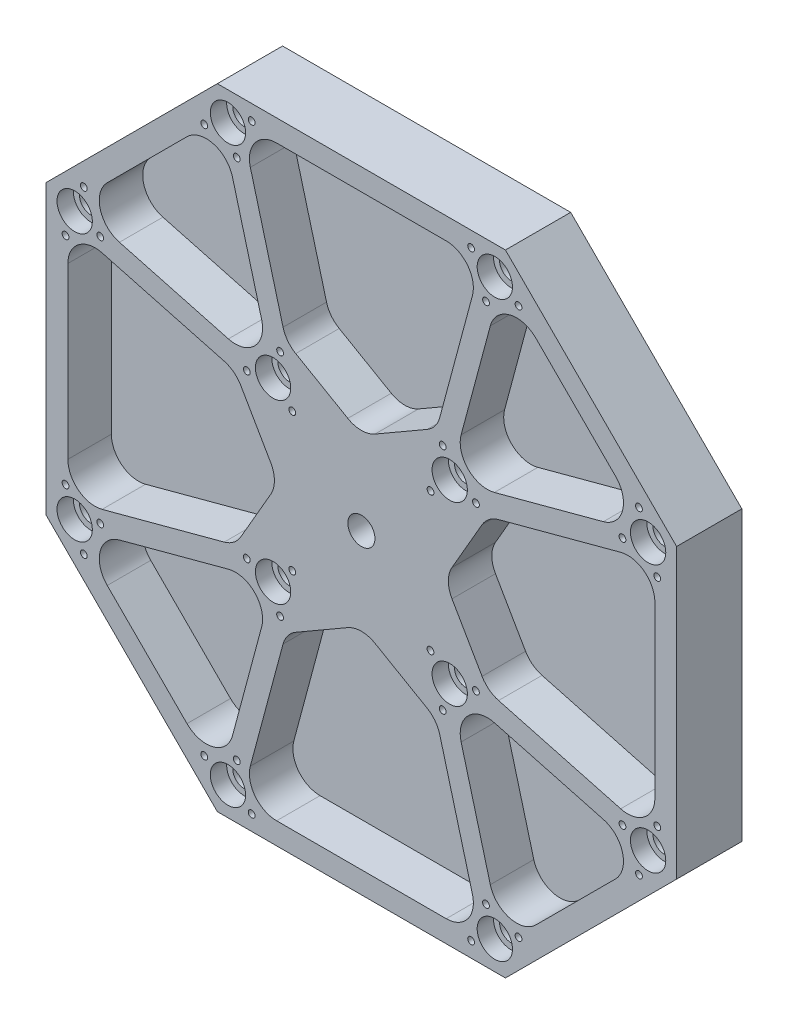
from build123d import *

# Parameters (mm, degrees)
BOSS_EXTRUDE1_DEPTH                              = 19.05
CUT_EXTRUDE1_DEPTH                               = 12.7
CIRPATTERN1_COUNT                                = 4
CUT_EXTRUDE2_DEPTH                               = 12.7
CIRPATTERN2_COUNT                                = 4
F_5_16_0_3125_DIAMETER_HOLE1_D                   = 7.9375
CBORE_FOR_1_4_SOCKET_SHOULDER_SCREW1_D           = 6.7564
CBORE_FOR_1_4_SOCKET_SHOULDER_SCREW1_CBORE_D     = 10.31748
CBORE_FOR_1_4_SOCKET_SHOULDER_SCREW1_CBORE_DEPTH = 4.7752
CIRPATTERN3_COUNT                                = 3
CIRPATTERN4_COUNT                                = 4
CBORE_FOR_1_4_SOCKET_SHOULDER_SCREW2_D           = 6.7564
CBORE_FOR_1_4_SOCKET_SHOULDER_SCREW2_CBORE_D     = 10.31748
CBORE_FOR_1_4_SOCKET_SHOULDER_SCREW2_CBORE_DEPTH = 4.7752
F_5_64_0_07813_DIAMETER_HOLE2_AT_2_COUNT         = 2
F_5_64_0_07813_DIAMETER_HOLE2_AT_2_PITCH         = 11.225320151
F_5_64_0_07813_DIAMETER_HOLE2_AT_3_COUNT         = 2
F_5_64_0_07813_DIAMETER_HOLE2_AT_3_PITCH         = 11.225320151
MIRROR2_COPY_3_D                                 = 6.7564
MIRROR2_COPY_3_CBORE_D                           = 10.31748
MIRROR2_COPY_3_CBORE_DEPTH                       = 4.7752
CBORE_FOR_1_4_SOCKET_SHOULDER_SCREW3_D           = 6.7564
CBORE_FOR_1_4_SOCKET_SHOULDER_SCREW3_CBORE_D     = 10.31748
CBORE_FOR_1_4_SOCKET_SHOULDER_SCREW3_CBORE_DEPTH = 4.7752
F_5_64_0_07813_DIAMETER_HOLE3_AT_2_COUNT         = 2
F_5_64_0_07813_DIAMETER_HOLE3_AT_2_PITCH         = 10.16390864
F_5_64_0_07813_DIAMETER_HOLE3_AT_3_COUNT         = 2
F_5_64_0_07813_DIAMETER_HOLE3_AT_3_PITCH         = 12.194695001
MIRROR4_COPY_3_D                                 = 6.7564
MIRROR4_COPY_3_CBORE_D                           = 10.31748
MIRROR4_COPY_3_CBORE_DEPTH                       = 4.7752


with BuildPart() as part:
    # Sketch1 → Boss-Extrude1 (new body)
    with BuildSketch(Plane.XY):
        Polygon((-42.075, 92.075), (42.075, 92.075), (92.075, 42.075), (92.075, -42.075), (42.075, -92.075), (-42.075, -92.075), (-92.075, -42.075), (-92.075, 42.075), align=None)
    extrude(amount=-BOSS_EXTRUDE1_DEPTH)

    # Sketch2 → Cut-Extrude1 (cut)
    with BuildSketch(Plane.XY):
        with BuildLine():
            Line((-24.770749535, 85.725), (24.770749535, 85.725))
            ThreePointArc((24.770749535, 85.725), (31.067991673, 82.619543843), (32.437785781, 75.733123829))
            Line((32.437785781, 75.733123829), (22.88106218, 40.066945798))
            ThreePointArc((22.88106218, 40.066945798), (21.511268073, 37.289278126), (19.182775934, 35.247245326))
            Line((19.182775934, 35.247245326), (3.96875, 26.463423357))
            ThreePointArc((3.96875, 26.463423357), (0, 25.4), (-3.96875, 26.463423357))
            Line((-3.96875, 26.463423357), (-19.182775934, 35.247245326))
            ThreePointArc((-19.182775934, 35.247245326), (-21.511268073, 37.289278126), (-22.88106218, 40.066945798))
            Line((-22.88106218, 40.066945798), (-32.437785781, 75.733123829))
            ThreePointArc((-32.437785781, 75.733123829), (-31.067991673, 82.619543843), (-24.770749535, 85.725))
        make_face()
    cut_extrude1 = extrude(amount=-CUT_EXTRUDE1_DEPTH, mode=Mode.SUBTRACT)

    # CirPattern1: Cut-Extrude1 ×4 about axis
    cirpattern1_axis = Axis((0, 0, 0), (0, 0, 1))
    for i in range(1, CIRPATTERN1_COUNT):
        add(cut_extrude1.rotate(cirpattern1_axis, i * 360 / CIRPATTERN1_COUNT), mode=Mode.SUBTRACT)

    # Sketch4 → Cut-Extrude2 (cut)
    with BuildSketch(Plane.XY):
        with BuildLine():
            Line((74.233516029, 50.93622785), (50.93622785, 74.233516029))
            ThreePointArc((50.93622785, 74.233516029), (43.269191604, 76.287892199), (37.656531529, 70.675232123))
            Line((37.656531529, 70.675232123), (29.129132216, 38.850544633))
            ThreePointArc((29.129132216, 38.850544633), (31.183508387, 31.183508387), (38.850544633, 29.129132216))
            Line((38.850544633, 29.129132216), (70.675232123, 37.656531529))
            ThreePointArc((70.675232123, 37.656531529), (76.287892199, 43.269191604), (74.233516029, 50.93622785))
        make_face()
    cut_extrude2 = extrude(amount=-CUT_EXTRUDE2_DEPTH, mode=Mode.SUBTRACT)

    # CirPattern2: Cut-Extrude2 ×4 about axis
    cirpattern2_axis = Axis((0, 0, 0), (0, 0, 1))
    for i in range(1, CIRPATTERN2_COUNT):
        add(cut_extrude2.rotate(cirpattern2_axis, i * 360 / CIRPATTERN2_COUNT), mode=Mode.SUBTRACT)

    # 5_16 _0.3125_ Diameter Hole1 (through all)
    with Locations(Plane.XY):
        with Locations((0, 0)):
            Hole(F_5_16_0_3125_DIAMETER_HOLE1_D / 2)

    # CBORE for 1_4 Socket Shoulder Screw1 (through all)
    with Locations(Plane.XY):
        with Locations((-25.795354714, -25.795354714)):
            cbore_for_1_4_socket_shoulder_screw1 = CounterBoreHole(CBORE_FOR_1_4_SOCKET_SHOULDER_SCREW1_D / 2, CBORE_FOR_1_4_SOCKET_SHOULDER_SCREW1_CBORE_D / 2, CBORE_FOR_1_4_SOCKET_SHOULDER_SCREW1_CBORE_DEPTH)

    # Sketch11 → 5_64 _0.07813_ Diameter Hole1 (revolve, cut)
    with BuildSketch(Plane(origin=(-20.182694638, -20.182694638, 0), x_dir=(0, -1, 0), z_dir=(1, 0, 0))):
        Polygon((0, 0), (0, 6.94620455), (0.992251, 6.35), (0.992251, 0), align=None)
    f_5_64_0_07813_diameter_hole1 = revolve(axis=Axis((-20.182694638, -20.182694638, 6.35), (0, 0, -1)), mode=Mode.SUBTRACT)

    # CirPattern3: 5_64 _0.07813_ Diameter Hole1 ×3 about axis
    cirpattern3_axis = Axis((-25.795354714, -25.795354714, 0), (0, 0, 1))
    for i in range(1, CIRPATTERN3_COUNT):
        add(f_5_64_0_07813_diameter_hole1.rotate(cirpattern3_axis, i * 360 / CIRPATTERN3_COUNT), mode=Mode.SUBTRACT)

    # CirPattern4: CBORE for 1_4 Socket Shoulder Screw1, 5_64 _0.07813_ Diameter Hole1 ×4 about axis
    cirpattern4_axis = Axis((0, 0, 0), (0, 0, 1))
    add([cbore_for_1_4_socket_shoulder_screw1.rotate(cirpattern4_axis, i * 360 / CIRPATTERN4_COUNT) for i in range(1, CIRPATTERN4_COUNT)], mode=Mode.SUBTRACT)
    add([f_5_64_0_07813_diameter_hole1.rotate(cirpattern4_axis, i * 360 / CIRPATTERN4_COUNT) for i in range(1, CIRPATTERN4_COUNT)], mode=Mode.SUBTRACT)

    # CirPattern4 copy 1 sketch → CirPattern4 copy 1 (revolve, cut)
    with BuildSketch(Plane(origin=(23.740978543, -33.46239096, 0), x_dir=(-0.4999999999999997, 0.8660254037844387, 0), z_dir=(-0.8660254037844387, -0.4999999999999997, 0))):
        Polygon((0, 0), (0, 6.94620455), (0.992251, 6.35), (0.992251, 0), align=None)
    revolve(axis=Axis((23.740978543, -33.46239096, 6.35), (0, 0, -1)), mode=Mode.SUBTRACT)

    # CirPattern4 copy 2 sketch → CirPattern4 copy 2 (revolve, cut)
    with BuildSketch(Plane(origin=(33.46239096, 23.740978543, 0), x_dir=(-0.8660254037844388, -0.49999999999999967, 0), z_dir=(0.49999999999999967, -0.8660254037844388, 0))):
        Polygon((0, 0), (0, 6.94620455), (0.992251, 6.35), (0.992251, 0), align=None)
    revolve(axis=Axis((33.46239096, 23.740978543, 6.35), (0, 0, -1)), mode=Mode.SUBTRACT)

    # CirPattern4 copy 3 sketch → CirPattern4 copy 3 (revolve, cut)
    with BuildSketch(Plane(origin=(-23.740978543, 33.46239096, 0), x_dir=(0.4999999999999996, -0.8660254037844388, 0), z_dir=(0.8660254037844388, 0.4999999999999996, 0))):
        Polygon((0, 0), (0, 6.94620455), (0.992251, 6.35), (0.992251, 0), align=None)
    revolve(axis=Axis((-23.740978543, 33.46239096, 6.35), (0, 0, -1)), mode=Mode.SUBTRACT)

    # CirPattern4 copy 4 sketch → CirPattern4 copy 4 (revolve, cut)
    with BuildSketch(Plane(origin=(33.46239096, -23.740978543, 0), x_dir=(-0.5000000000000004, -0.8660254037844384, 0), z_dir=(0.8660254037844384, -0.5000000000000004, 0))):
        Polygon((0, 0), (0, 6.94620455), (0.992251, 6.35), (0.992251, 0), align=None)
    revolve(axis=Axis((33.46239096, -23.740978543, 6.35), (0, 0, -1)), mode=Mode.SUBTRACT)

    # CirPattern4 copy 5 sketch → CirPattern4 copy 5 (revolve, cut)
    with BuildSketch(Plane(origin=(23.740978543, 33.46239096, 0), x_dir=(0.8660254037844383, -0.5000000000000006, 0), z_dir=(0.5000000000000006, 0.8660254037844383, 0))):
        Polygon((0, 0), (0, 6.94620455), (0.992251, 6.35), (0.992251, 0), align=None)
    revolve(axis=Axis((23.740978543, 33.46239096, 6.35), (0, 0, -1)), mode=Mode.SUBTRACT)

    # CirPattern4 copy 6 sketch → CirPattern4 copy 6 (revolve, cut)
    with BuildSketch(Plane(origin=(-33.46239096, 23.740978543, 0), x_dir=(0.5000000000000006, 0.8660254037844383, 0), z_dir=(-0.8660254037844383, 0.5000000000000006, 0))):
        Polygon((0, 0), (0, 6.94620455), (0.992251, 6.35), (0.992251, 0), align=None)
    revolve(axis=Axis((-33.46239096, 23.740978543, 6.35), (0, 0, -1)), mode=Mode.SUBTRACT)

    # CBORE for 1_4 Socket Shoulder Screw2 (through all)
    with Locations(Plane.XY):
        with Locations((83.743984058, 38.972376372)):
            cbore_for_1_4_socket_shoulder_screw2 = CounterBoreHole(CBORE_FOR_1_4_SOCKET_SHOULDER_SCREW2_D / 2, CBORE_FOR_1_4_SOCKET_SHOULDER_SCREW2_CBORE_D / 2, CBORE_FOR_1_4_SOCKET_SHOULDER_SCREW2_CBORE_DEPTH)

    # Sketch15 → 5_64 _0.07813_ Diameter Hole2 (revolve, cut)
    with BuildSketch(Plane(origin=(76.270596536, 36.297982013, 0), x_dir=(0, -1, 0), z_dir=(1, 0, 0))):
        Polygon((0, 0), (0, 6.94620455), (0.992251, 6.35), (0.992251, 0), align=None)
    f_5_64_0_07813_diameter_hole2 = revolve(axis=Axis((76.270596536, 36.297982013, 6.35), (0, 0, -1)), mode=Mode.SUBTRACT)

    # 5_64 _0.07813_ Diameter Hole2 at 2: 5_64 _0.07813_ Diameter Hole2 ×2
    with Locations(*[Vector(0.9040082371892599, -0.427515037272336, 0) * (i * F_5_64_0_07813_DIAMETER_HOLE2_AT_2_PITCH) for i in range(1, F_5_64_0_07813_DIAMETER_HOLE2_AT_2_COUNT)]):
        add(f_5_64_0_07813_diameter_hole2, mode=Mode.SUBTRACT)

    # 5_64 _0.07813_ Diameter Hole2 at 3: 5_64 _0.07813_ Diameter Hole2 ×2
    with Locations(*[Vector(0.42751503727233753, 0.9040082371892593, 0) * (i * F_5_64_0_07813_DIAMETER_HOLE2_AT_3_PITCH) for i in range(1, F_5_64_0_07813_DIAMETER_HOLE2_AT_3_COUNT)]):
        add(f_5_64_0_07813_diameter_hole2, mode=Mode.SUBTRACT)

    # Mirror1: CBORE for 1_4 Socket Shoulder Screw2, 5_64 _0.07813_ Diameter Hole2 across plane
    add(cbore_for_1_4_socket_shoulder_screw2.mirror(Plane.ZX), mode=Mode.SUBTRACT)
    add(f_5_64_0_07813_diameter_hole2.mirror(Plane.ZX), mode=Mode.SUBTRACT)

    # Mirror1 copy 1 sketch → Mirror1 copy 1 (revolve, cut)
    with BuildSketch(Plane(origin=(86.418378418, -31.49898885, 0), x_dir=(0, 1, 0), z_dir=(1, 0, 0))):
        Polygon((0, 0), (0, -6.94620455), (0.992251, -6.35), (0.992251, 0), align=None)
    revolve(axis=Axis((86.418378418, -31.49898885, 6.35), (0, 0, 1)), mode=Mode.SUBTRACT)

    # Mirror1 copy 2 sketch → Mirror1 copy 2 (revolve, cut)
    with BuildSketch(Plane(origin=(81.069589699, -46.445763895, 0), x_dir=(0, 1, 0), z_dir=(1, 0, 0))):
        Polygon((0, 0), (0, -6.94620455), (0.992251, -6.35), (0.992251, 0), align=None)
    revolve(axis=Axis((81.069589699, -46.445763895, 6.35), (0, 0, 1)), mode=Mode.SUBTRACT)

    # Mirror2: CBORE for 1_4 Socket Shoulder Screw2, 5_64 _0.07813_ Diameter Hole2 across plane
    add(cbore_for_1_4_socket_shoulder_screw2.mirror(Plane(origin=(0, 0, 0), x_dir=(0, 0, 1), z_dir=(1, 0, 0))), mode=Mode.SUBTRACT)
    add(f_5_64_0_07813_diameter_hole2.mirror(Plane(origin=(0, 0, 0), x_dir=(0, 0, 1), z_dir=(1, 0, 0))), mode=Mode.SUBTRACT)

    # Mirror2 copy 1 sketch → Mirror2 copy 1 (revolve, cut)
    with BuildSketch(Plane(origin=(-86.418378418, 31.49898885, 0), x_dir=(0, -1, 0), z_dir=(-1, 0, 0))):
        Polygon((0, 0), (0, -6.94620455), (0.992251, -6.35), (0.992251, 0), align=None)
    revolve(axis=Axis((-86.418378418, 31.49898885, 6.35), (0, 0, 1)), mode=Mode.SUBTRACT)

    # Mirror2 copy 2 sketch → Mirror2 copy 2 (revolve, cut)
    with BuildSketch(Plane(origin=(-81.069589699, 46.445763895, 0), x_dir=(0, -1, 0), z_dir=(-1, 0, 0))):
        Polygon((0, 0), (0, -6.94620455), (0.992251, -6.35), (0.992251, 0), align=None)
    revolve(axis=Axis((-81.069589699, 46.445763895, 6.35), (0, 0, 1)), mode=Mode.SUBTRACT)

    # Mirror2 copy 3 (through all)
    with Locations(Plane(origin=(0, 0, 0), x_dir=(-1, 0, 0), z_dir=(0, 0, 1))):
        with Locations((83.743984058, 38.972376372)):
            CounterBoreHole(MIRROR2_COPY_3_D / 2, MIRROR2_COPY_3_CBORE_D / 2, MIRROR2_COPY_3_CBORE_DEPTH)

    # Mirror2 copy 4 sketch → Mirror2 copy 4 (revolve, cut)
    with BuildSketch(Plane(origin=(-76.270596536, -36.297982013, 0), x_dir=(0, 1, 0), z_dir=(-1, 0, 0))):
        Polygon((0, 0), (0, 6.94620455), (0.992251, 6.35), (0.992251, 0), align=None)
    revolve(axis=Axis((-76.270596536, -36.297982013, 6.35), (0, 0, -1)), mode=Mode.SUBTRACT)

    # Mirror2 copy 5 sketch → Mirror2 copy 5 (revolve, cut)
    with BuildSketch(Plane(origin=(-86.418378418, -31.49898885, 0), x_dir=(0, 1, 0), z_dir=(-1, 0, 0))):
        Polygon((0, 0), (0, 6.94620455), (0.992251, 6.35), (0.992251, 0), align=None)
    revolve(axis=Axis((-86.418378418, -31.49898885, 6.35), (0, 0, -1)), mode=Mode.SUBTRACT)

    # Mirror2 copy 6 sketch → Mirror2 copy 6 (revolve, cut)
    with BuildSketch(Plane(origin=(-81.069589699, -46.445763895, 0), x_dir=(0, 1, 0), z_dir=(-1, 0, 0))):
        Polygon((0, 0), (0, 6.94620455), (0.992251, 6.35), (0.992251, 0), align=None)
    revolve(axis=Axis((-81.069589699, -46.445763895, 6.35), (0, 0, -1)), mode=Mode.SUBTRACT)

    # CBORE for 1_4 Socket Shoulder Screw3 (through all)
    with Locations(Plane.XY):
        with Locations((38.972376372, 83.743984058)):
            cbore_for_1_4_socket_shoulder_screw3 = CounterBoreHole(CBORE_FOR_1_4_SOCKET_SHOULDER_SCREW3_D / 2, CBORE_FOR_1_4_SOCKET_SHOULDER_SCREW3_CBORE_D / 2, CBORE_FOR_1_4_SOCKET_SHOULDER_SCREW3_CBORE_DEPTH)

    # Sketch20 → 5_64 _0.07813_ Diameter Hole3 (revolve, cut)
    with BuildSketch(Plane(origin=(36.396939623, 76.235919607, 0), x_dir=(0, -1, 0), z_dir=(1, 0, 0))):
        Polygon((0, 0), (0, 6.94620455), (0.992251, 6.35), (0.992251, 0), align=None)
    f_5_64_0_07813_diameter_hole3 = revolve(axis=Axis((36.396939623, 76.235919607, 6.35), (0, 0, -1)), mode=Mode.SUBTRACT)

    # 5_64 _0.07813_ Diameter Hole3 at 2: 5_64 _0.07813_ Diameter Hole3 ×2
    with Locations(*[Vector(0.9343473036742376, 0.35636374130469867, 0) * (i * F_5_64_0_07813_DIAMETER_HOLE3_AT_2_PITCH) for i in range(1, F_5_64_0_07813_DIAMETER_HOLE3_AT_2_COUNT)]):
        add(f_5_64_0_07813_diameter_hole3, mode=Mode.SUBTRACT)

    # 5_64 _0.07813_ Diameter Hole3 at 3: 5_64 _0.07813_ Diameter Hole3 ×2
    with Locations(*[Vector(-0.356363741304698, 0.9343473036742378, 0) * (i * F_5_64_0_07813_DIAMETER_HOLE3_AT_3_PITCH) for i in range(1, F_5_64_0_07813_DIAMETER_HOLE3_AT_3_COUNT)]):
        add(f_5_64_0_07813_diameter_hole3, mode=Mode.SUBTRACT)

    # Mirror3: CBORE for 1_4 Socket Shoulder Screw3, 5_64 _0.07813_ Diameter Hole3 across plane
    add(cbore_for_1_4_socket_shoulder_screw3.mirror(Plane(origin=(0, 0, 0), x_dir=(0, 0, 1), z_dir=(1, 0, 0))), mode=Mode.SUBTRACT)
    add(f_5_64_0_07813_diameter_hole3.mirror(Plane(origin=(0, 0, 0), x_dir=(0, 0, 1), z_dir=(1, 0, 0))), mode=Mode.SUBTRACT)

    # Mirror3 copy 1 sketch → Mirror3 copy 1 (revolve, cut)
    with BuildSketch(Plane(origin=(-45.893560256, 79.857968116, 0), x_dir=(0, -1, 0), z_dir=(-1, 0, 0))):
        Polygon((0, 0), (0, -6.94620455), (0.992251, -6.35), (0.992251, 0), align=None)
    revolve(axis=Axis((-45.893560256, 79.857968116, 6.35), (0, 0, 1)), mode=Mode.SUBTRACT)

    # Mirror3 copy 2 sketch → Mirror3 copy 2 (revolve, cut)
    with BuildSketch(Plane(origin=(-32.051192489, 87.63, 0), x_dir=(0, -1, 0), z_dir=(-1, 0, 0))):
        Polygon((0, 0), (0, -6.94620455), (0.992251, -6.35), (0.992251, 0), align=None)
    revolve(axis=Axis((-32.051192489, 87.63, 6.35), (0, 0, 1)), mode=Mode.SUBTRACT)

    # Mirror4: CBORE for 1_4 Socket Shoulder Screw3, 5_64 _0.07813_ Diameter Hole3 across plane
    add(cbore_for_1_4_socket_shoulder_screw3.mirror(Plane.ZX), mode=Mode.SUBTRACT)
    add(f_5_64_0_07813_diameter_hole3.mirror(Plane.ZX), mode=Mode.SUBTRACT)

    # Mirror4 copy 1 sketch → Mirror4 copy 1 (revolve, cut)
    with BuildSketch(Plane(origin=(45.893560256, -79.857968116, 0), x_dir=(0, 1, 0), z_dir=(1, 0, 0))):
        Polygon((0, 0), (0, -6.94620455), (0.992251, -6.35), (0.992251, 0), align=None)
    revolve(axis=Axis((45.893560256, -79.857968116, 6.35), (0, 0, 1)), mode=Mode.SUBTRACT)

    # Mirror4 copy 2 sketch → Mirror4 copy 2 (revolve, cut)
    with BuildSketch(Plane(origin=(32.051192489, -87.63, 0), x_dir=(0, 1, 0), z_dir=(1, 0, 0))):
        Polygon((0, 0), (0, -6.94620455), (0.992251, -6.35), (0.992251, 0), align=None)
    revolve(axis=Axis((32.051192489, -87.63, 6.35), (0, 0, 1)), mode=Mode.SUBTRACT)

    # Mirror4 copy 3 (through all)
    with Locations(Plane(origin=(0, 0, 0), x_dir=(-1, 0, 0), z_dir=(0, 0, 1))):
        with Locations((38.972376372, 83.743984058)):
            CounterBoreHole(MIRROR4_COPY_3_D / 2, MIRROR4_COPY_3_CBORE_D / 2, MIRROR4_COPY_3_CBORE_DEPTH)

    # Mirror4 copy 4 sketch → Mirror4 copy 4 (revolve, cut)
    with BuildSketch(Plane(origin=(-36.396939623, -76.235919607, 0), x_dir=(0, 1, 0), z_dir=(-1, 0, 0))):
        Polygon((0, 0), (0, 6.94620455), (0.992251, 6.35), (0.992251, 0), align=None)
    revolve(axis=Axis((-36.396939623, -76.235919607, 6.35), (0, 0, -1)), mode=Mode.SUBTRACT)

    # Mirror4 copy 5 sketch → Mirror4 copy 5 (revolve, cut)
    with BuildSketch(Plane(origin=(-45.893560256, -79.857968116, 0), x_dir=(0, 1, 0), z_dir=(-1, 0, 0))):
        Polygon((0, 0), (0, 6.94620455), (0.992251, 6.35), (0.992251, 0), align=None)
    revolve(axis=Axis((-45.893560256, -79.857968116, 6.35), (0, 0, -1)), mode=Mode.SUBTRACT)

    # Mirror4 copy 6 sketch → Mirror4 copy 6 (revolve, cut)
    with BuildSketch(Plane(origin=(-32.051192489, -87.63, 0), x_dir=(0, 1, 0), z_dir=(-1, 0, 0))):
        Polygon((0, 0), (0, 6.94620455), (0.992251, 6.35), (0.992251, 0), align=None)
    revolve(axis=Axis((-32.051192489, -87.63, 6.35), (0, 0, -1)), mode=Mode.SUBTRACT)


solid = part.part
